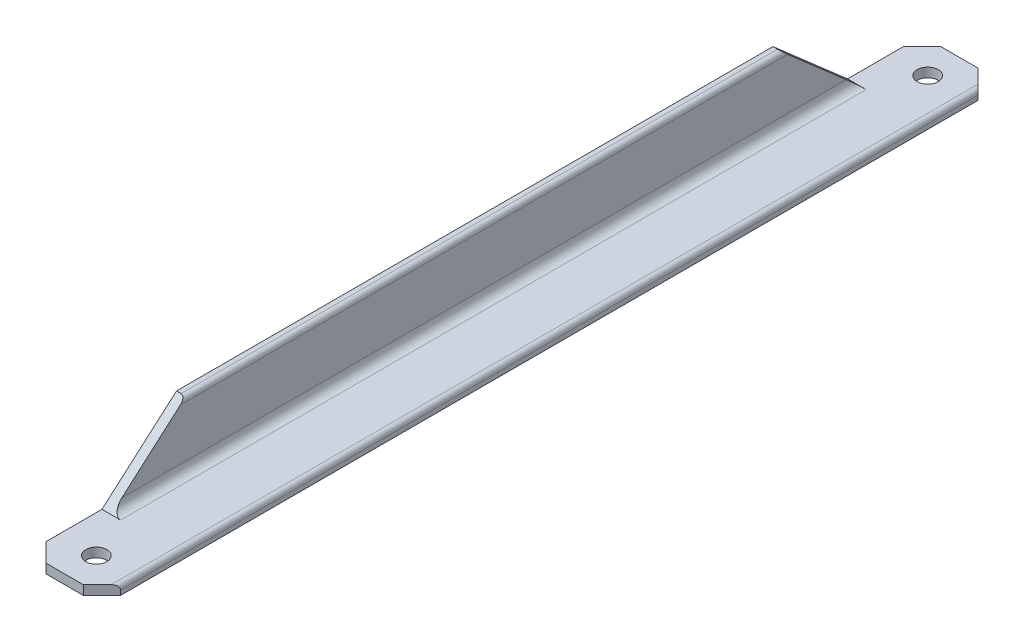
ISO-10303-21;
HEADER;
FILE_DESCRIPTION(('STEP AP214'),'2;1');
FILE_NAME('part.step','',(''),(''),'','','');
FILE_SCHEMA(('AUTOMOTIVE_DESIGN { 1 0 10303 214 1 1 1 1 }'));
ENDSEC;
DATA;
#1=APPLICATION_CONTEXT('core data for automotive mechanical design processes');
#2=APPLICATION_PROTOCOL_DEFINITION('international standard','automotive_design',2000,#1);
#3=PRODUCT_CONTEXT('',#1,'mechanical');
#4=PRODUCT('Part','Part','',(#3));
#5=PRODUCT_RELATED_PRODUCT_CATEGORY('part','',(#4));
#6=PRODUCT_DEFINITION_FORMATION('','',#4);
#7=PRODUCT_DEFINITION_CONTEXT('part definition',#1,'design');
#8=PRODUCT_DEFINITION('design','',#6,#7);
#9=PRODUCT_DEFINITION_SHAPE('','',#8);
#10=(LENGTH_UNIT() NAMED_UNIT(*) SI_UNIT(.MILLI.,.METRE.));
#11=(NAMED_UNIT(*) PLANE_ANGLE_UNIT() SI_UNIT($,.RADIAN.));
#12=(NAMED_UNIT(*) SI_UNIT($,.STERADIAN.) SOLID_ANGLE_UNIT());
#13=UNCERTAINTY_MEASURE_WITH_UNIT(LENGTH_MEASURE(1.E-05),#10,'distance_accuracy_value','');
#14=(GEOMETRIC_REPRESENTATION_CONTEXT(3) GLOBAL_UNCERTAINTY_ASSIGNED_CONTEXT((#13)) GLOBAL_UNIT_ASSIGNED_CONTEXT((#10,
#11,#12)) REPRESENTATION_CONTEXT('',''));
#15=CARTESIAN_POINT('',(0.,0.,0.));
#16=DIRECTION('',(0.,0.,1.));
#17=DIRECTION('',(1.,0.,0.));
#18=AXIS2_PLACEMENT_3D('',#15,#16,#17);
#19=CARTESIAN_POINT('',(0.,0.,304.800000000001));
#20=DIRECTION('',(0.,1.,0.));
#21=DIRECTION('',(0.,0.,1.));
#22=AXIS2_PLACEMENT_3D('',#19,#20,#21);
#23=PLANE('',#22);
#24=CARTESIAN_POINT('',(25.4,-1.66533453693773E-13,283.210000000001));
#25=DIRECTION('',(0.,1.,0.));
#26=DIRECTION('',(0.,0.,-1.));
#27=AXIS2_PLACEMENT_3D('',#24,#25,#26);
#28=CIRCLE('',#27,7.1374);
#29=CARTESIAN_POINT('',(25.4,-1.66533453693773E-13,276.072600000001));
#30=VERTEX_POINT('',#29);
#31=EDGE_CURVE('E276',#30,#30,#28,.T.);
#32=ORIENTED_EDGE('',*,*,#31,.T.);
#33=EDGE_LOOP('',(#32));
#34=FACE_BOUND('',#33,.T.);
#35=CARTESIAN_POINT('',(25.4,-1.66533453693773E-13,-283.21));
#36=DIRECTION('',(0.,1.,0.));
#37=DIRECTION('',(0.,0.,1.));
#38=AXIS2_PLACEMENT_3D('',#35,#36,#37);
#39=CIRCLE('',#38,7.1374);
#40=CARTESIAN_POINT('',(25.4,-1.66533453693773E-13,-276.0726));
#41=VERTEX_POINT('',#40);
#42=EDGE_CURVE('E268',#41,#41,#39,.T.);
#43=ORIENTED_EDGE('',*,*,#42,.T.);
#44=EDGE_LOOP('',(#43));
#45=FACE_BOUND('',#44,.T.);
#46=DIRECTION('',(1.,0.,0.));
#47=VECTOR('',#46,1.);
#48=CARTESIAN_POINT('',(0.,0.,-304.8));
#49=LINE('',#48,#47);
#50=CARTESIAN_POINT('',(12.7,-1.66533453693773E-13,-304.8));
#51=VERTEX_POINT('',#50);
#52=CARTESIAN_POINT('',(38.1,0.,-304.8));
#53=VERTEX_POINT('',#52);
#54=EDGE_CURVE('E160',#51,#53,#49,.T.);
#55=ORIENTED_EDGE('',*,*,#54,.T.);
#56=DIRECTION('',(0.707106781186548,0.,0.707106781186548));
#57=VECTOR('',#56,1.);
#58=CARTESIAN_POINT('',(38.1,0.,-304.8));
#59=LINE('',#58,#57);
#60=CARTESIAN_POINT('',(50.8,0.,-292.1));
#61=VERTEX_POINT('',#60);
#62=EDGE_CURVE('E144',#53,#61,#59,.T.);
#63=ORIENTED_EDGE('',*,*,#62,.T.);
#64=DIRECTION('',(0.,0.,-1.));
#65=VECTOR('',#64,1.);
#66=CARTESIAN_POINT('',(50.8,0.,304.800000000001));
#67=LINE('',#66,#65);
#68=CARTESIAN_POINT('',(50.8,0.,292.100000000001));
#69=VERTEX_POINT('',#68);
#70=EDGE_CURVE('E11',#69,#61,#67,.T.);
#71=ORIENTED_EDGE('',*,*,#70,.F.);
#72=DIRECTION('',(-0.707106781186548,0.,0.707106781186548));
#73=VECTOR('',#72,1.);
#74=CARTESIAN_POINT('',(38.1,0.,304.800000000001));
#75=LINE('',#74,#73);
#76=CARTESIAN_POINT('',(38.1,0.,304.800000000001));
#77=VERTEX_POINT('',#76);
#78=EDGE_CURVE('E168',#69,#77,#75,.T.);
#79=ORIENTED_EDGE('',*,*,#78,.T.);
#80=DIRECTION('',(1.,0.,0.));
#81=VECTOR('',#80,1.);
#82=CARTESIAN_POINT('',(0.,0.,304.800000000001));
#83=LINE('',#82,#81);
#84=CARTESIAN_POINT('',(12.6999999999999,-1.66533453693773E-13,304.800000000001));
#85=VERTEX_POINT('',#84);
#86=EDGE_CURVE('E238',#85,#77,#83,.T.);
#87=ORIENTED_EDGE('',*,*,#86,.F.);
#88=DIRECTION('',(-0.707106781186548,0.,-0.707106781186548));
#89=VECTOR('',#88,1.);
#90=CARTESIAN_POINT('',(12.6999999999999,-1.66533453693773E-13,304.800000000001));
#91=LINE('',#90,#89);
#92=CARTESIAN_POINT('',(0.,0.,292.100000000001));
#93=VERTEX_POINT('',#92);
#94=EDGE_CURVE('E50',#85,#93,#91,.T.);
#95=ORIENTED_EDGE('',*,*,#94,.T.);
#96=DIRECTION('',(0.,0.,-1.));
#97=VECTOR('',#96,1.);
#98=CARTESIAN_POINT('',(0.,0.,304.800000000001));
#99=LINE('',#98,#97);
#100=CARTESIAN_POINT('',(0.,0.,-292.1));
#101=VERTEX_POINT('',#100);
#102=EDGE_CURVE('E245',#93,#101,#99,.T.);
#103=ORIENTED_EDGE('',*,*,#102,.T.);
#104=DIRECTION('',(0.707106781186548,0.,-0.707106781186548));
#105=VECTOR('',#104,1.);
#106=CARTESIAN_POINT('',(12.7,-1.66533453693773E-13,-304.8));
#107=LINE('',#106,#105);
#108=EDGE_CURVE('E189',#101,#51,#107,.T.);
#109=ORIENTED_EDGE('',*,*,#108,.T.);
#110=EDGE_LOOP('',(#55,#63,#71,#79,#87,#95,#103,#109));
#111=FACE_BOUND('',#110,.T.);
#112=ADVANCED_FACE('F34',(#34,#45,#111),#23,.F.);
#113=CARTESIAN_POINT('',(50.8,3.17499999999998,304.800000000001));
#114=DIRECTION('',(-1.,0.,0.));
#115=DIRECTION('',(0.,0.,1.));
#116=AXIS2_PLACEMENT_3D('',#113,#114,#115);
#117=PLANE('',#116);
#118=ORIENTED_EDGE('',*,*,#70,.T.);
#119=DIRECTION('',(0.,1.,0.));
#120=VECTOR('',#119,1.);
#121=CARTESIAN_POINT('',(50.8,0.,-292.1));
#122=LINE('',#121,#120);
#123=CARTESIAN_POINT('',(50.8,3.17499999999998,-292.1));
#124=VERTEX_POINT('',#123);
#125=EDGE_CURVE('E141',#61,#124,#122,.T.);
#126=ORIENTED_EDGE('',*,*,#125,.T.);
#127=DIRECTION('',(0.,0.,-1.));
#128=VECTOR('',#127,1.);
#129=CARTESIAN_POINT('',(50.8,3.17499999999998,304.800000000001));
#130=LINE('',#129,#128);
#131=CARTESIAN_POINT('',(50.8,3.17499999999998,292.100000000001));
#132=VERTEX_POINT('',#131);
#133=EDGE_CURVE('E42',#132,#124,#130,.T.);
#134=ORIENTED_EDGE('',*,*,#133,.F.);
#135=DIRECTION('',(0.,1.,0.));
#136=VECTOR('',#135,1.);
#137=CARTESIAN_POINT('',(50.8,0.,292.100000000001));
#138=LINE('',#137,#136);
#139=EDGE_CURVE('E161',#69,#132,#138,.T.);
#140=ORIENTED_EDGE('',*,*,#139,.F.);
#141=EDGE_LOOP('',(#118,#126,#134,#140));
#142=FACE_BOUND('',#141,.T.);
#143=ADVANCED_FACE('F164',(#142),#117,.F.);
#144=CARTESIAN_POINT('',(47.625,3.17499999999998,304.800000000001));
#145=DIRECTION('',(0.,0.,-1.));
#146=DIRECTION('',(-1.,0.,0.));
#147=AXIS2_PLACEMENT_3D('',#144,#145,#146);
#148=CYLINDRICAL_SURFACE('',#147,3.175);
#149=ORIENTED_EDGE('',*,*,#133,.T.);
#150=CARTESIAN_POINT('',(47.625,3.17499999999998,-295.275));
#151=DIRECTION('',(-0.707106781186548,0.,0.707106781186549));
#152=DIRECTION('',(-0.707106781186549,0.,-0.707106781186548));
#153=AXIS2_PLACEMENT_3D('',#150,#151,#152);
#154=ELLIPSE('',#153,4.49012806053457,3.175);
#155=CARTESIAN_POINT('',(47.625,6.35000000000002,-295.275));
#156=VERTEX_POINT('',#155);
#157=EDGE_CURVE('E147',#124,#156,#154,.T.);
#158=ORIENTED_EDGE('',*,*,#157,.T.);
#159=DIRECTION('',(0.,0.,-1.));
#160=VECTOR('',#159,1.);
#161=CARTESIAN_POINT('',(47.625,6.35000000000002,304.800000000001));
#162=LINE('',#161,#160);
#163=CARTESIAN_POINT('',(47.625,6.35000000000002,295.275000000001));
#164=VERTEX_POINT('',#163);
#165=EDGE_CURVE('E264',#164,#156,#162,.T.);
#166=ORIENTED_EDGE('',*,*,#165,.F.);
#167=CARTESIAN_POINT('',(47.625,3.17499999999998,295.275000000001));
#168=DIRECTION('',(-0.707106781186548,0.,-0.707106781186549));
#169=DIRECTION('',(0.707106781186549,0.,-0.707106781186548));
#170=AXIS2_PLACEMENT_3D('',#167,#168,#169);
#171=ELLIPSE('',#170,4.49012806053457,3.175);
#172=EDGE_CURVE('E187',#164,#132,#171,.T.);
#173=ORIENTED_EDGE('',*,*,#172,.T.);
#174=EDGE_LOOP('',(#149,#158,#166,#173));
#175=FACE_BOUND('',#174,.T.);
#176=ADVANCED_FACE('F330',(#175),#148,.T.);
#177=CARTESIAN_POINT('',(12.7,6.34999999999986,304.800000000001));
#178=DIRECTION('',(0.,-1.,0.));
#179=DIRECTION('',(0.,0.,-1.));
#180=AXIS2_PLACEMENT_3D('',#177,#178,#179);
#181=PLANE('',#180);
#182=CARTESIAN_POINT('',(25.4,6.34999999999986,283.210000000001));
#183=DIRECTION('',(0.,-1.,0.));
#184=DIRECTION('',(0.,0.,-1.));
#185=AXIS2_PLACEMENT_3D('',#182,#183,#184);
#186=CIRCLE('',#185,7.1374);
#187=CARTESIAN_POINT('',(25.4,6.34999999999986,276.072600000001));
#188=VERTEX_POINT('',#187);
#189=EDGE_CURVE('E37',#188,#188,#186,.T.);
#190=ORIENTED_EDGE('',*,*,#189,.T.);
#191=EDGE_LOOP('',(#190));
#192=FACE_BOUND('',#191,.T.);
#193=CARTESIAN_POINT('',(25.3999999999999,6.34999999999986,-283.21));
#194=DIRECTION('',(0.,-1.,0.));
#195=DIRECTION('',(0.,0.,-1.));
#196=AXIS2_PLACEMENT_3D('',#193,#194,#195);
#197=CIRCLE('',#196,7.1374);
#198=CARTESIAN_POINT('',(25.3999999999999,6.34999999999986,-290.3474));
#199=VERTEX_POINT('',#198);
#200=EDGE_CURVE('E175',#199,#199,#197,.T.);
#201=ORIENTED_EDGE('',*,*,#200,.T.);
#202=EDGE_LOOP('',(#201));
#203=FACE_BOUND('',#202,.T.);
#204=ORIENTED_EDGE('',*,*,#165,.T.);
#205=DIRECTION('',(-0.707106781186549,0.,-0.707106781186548));
#206=VECTOR('',#205,1.);
#207=CARTESIAN_POINT('',(330.2,6.35000000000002,-12.7000000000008));
#208=LINE('',#207,#206);
#209=CARTESIAN_POINT('',(38.1,6.34999999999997,-304.8));
#210=VERTEX_POINT('',#209);
#211=EDGE_CURVE('E151',#156,#210,#208,.T.);
#212=ORIENTED_EDGE('',*,*,#211,.T.);
#213=DIRECTION('',(-1.,0.,0.));
#214=VECTOR('',#213,1.);
#215=CARTESIAN_POINT('',(12.7,6.34999999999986,-304.8));
#216=LINE('',#215,#214);
#217=CARTESIAN_POINT('',(12.7,6.34999999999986,-304.8));
#218=VERTEX_POINT('',#217);
#219=EDGE_CURVE('E242',#210,#218,#216,.T.);
#220=ORIENTED_EDGE('',*,*,#219,.T.);
#221=DIRECTION('',(-0.707106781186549,0.,0.707106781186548));
#222=VECTOR('',#221,1.);
#223=CARTESIAN_POINT('',(-292.1,6.34999999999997,-4.44089209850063E-13));
#224=LINE('',#223,#222);
#225=CARTESIAN_POINT('',(0.,6.35000000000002,-292.1));
#226=VERTEX_POINT('',#225);
#227=EDGE_CURVE('E195',#218,#226,#224,.T.);
#228=ORIENTED_EDGE('',*,*,#227,.T.);
#229=DIRECTION('',(0.,0.,-1.));
#230=VECTOR('',#229,1.);
#231=CARTESIAN_POINT('',(0.,6.35000000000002,-304.8));
#232=LINE('',#231,#230);
#233=CARTESIAN_POINT('',(0.,6.34999999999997,-254.));
#234=VERTEX_POINT('',#233);
#235=EDGE_CURVE('E202',#234,#226,#232,.T.);
#236=ORIENTED_EDGE('',*,*,#235,.F.);
#237=DIRECTION('',(1.,0.,0.));
#238=VECTOR('',#237,1.);
#239=CARTESIAN_POINT('',(0.,6.34999999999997,-254.));
#240=LINE('',#239,#238);
#241=CARTESIAN_POINT('',(12.7,6.34999999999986,-254.));
#242=VERTEX_POINT('',#241);
#243=EDGE_CURVE('E206',#234,#242,#240,.T.);
#244=ORIENTED_EDGE('',*,*,#243,.T.);
#245=DIRECTION('',(0.,0.,-1.));
#246=VECTOR('',#245,1.);
#247=CARTESIAN_POINT('',(12.7,6.34999999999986,304.800000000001));
#248=LINE('',#247,#246);
#249=CARTESIAN_POINT('',(12.7,6.34999999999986,254.));
#250=VERTEX_POINT('',#249);
#251=EDGE_CURVE('E261',#250,#242,#248,.T.);
#252=ORIENTED_EDGE('',*,*,#251,.F.);
#253=DIRECTION('',(1.,0.,0.));
#254=VECTOR('',#253,1.);
#255=CARTESIAN_POINT('',(0.,6.35000000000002,254.));
#256=LINE('',#255,#254);
#257=CARTESIAN_POINT('',(0.,6.35000000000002,254.));
#258=VERTEX_POINT('',#257);
#259=EDGE_CURVE('E224',#258,#250,#256,.T.);
#260=ORIENTED_EDGE('',*,*,#259,.F.);
#261=DIRECTION('',(0.,0.,-1.));
#262=VECTOR('',#261,1.);
#263=CARTESIAN_POINT('',(0.,6.35000000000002,304.800000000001));
#264=LINE('',#263,#262);
#265=CARTESIAN_POINT('',(0.,6.35000000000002,292.100000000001));
#266=VERTEX_POINT('',#265);
#267=EDGE_CURVE('E219',#266,#258,#264,.T.);
#268=ORIENTED_EDGE('',*,*,#267,.F.);
#269=DIRECTION('',(0.707106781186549,0.,0.707106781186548));
#270=VECTOR('',#269,1.);
#271=CARTESIAN_POINT('',(12.6999999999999,6.34999999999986,304.800000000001));
#272=LINE('',#271,#270);
#273=CARTESIAN_POINT('',(12.6999999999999,6.34999999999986,304.800000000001));
#274=VERTEX_POINT('',#273);
#275=EDGE_CURVE('E183',#266,#274,#272,.T.);
#276=ORIENTED_EDGE('',*,*,#275,.T.);
#277=DIRECTION('',(-1.,0.,0.));
#278=VECTOR('',#277,1.);
#279=CARTESIAN_POINT('',(12.7,6.34999999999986,304.800000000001));
#280=LINE('',#279,#278);
#281=CARTESIAN_POINT('',(38.0999999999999,6.34999999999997,304.800000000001));
#282=VERTEX_POINT('',#281);
#283=EDGE_CURVE('E241',#282,#274,#280,.T.);
#284=ORIENTED_EDGE('',*,*,#283,.F.);
#285=DIRECTION('',(0.707106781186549,0.,-0.707106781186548));
#286=VECTOR('',#285,1.);
#287=CARTESIAN_POINT('',(25.3999999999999,6.34999999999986,317.500000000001));
#288=LINE('',#287,#286);
#289=EDGE_CURVE('E58',#282,#164,#288,.T.);
#290=ORIENTED_EDGE('',*,*,#289,.T.);
#291=EDGE_LOOP('',(#204,#212,#220,#228,#236,#244,#252,#260,#268,#276,#284,#290));
#292=FACE_BOUND('',#291,.T.);
#293=ADVANCED_FACE('F281',(#192,#203,#292),#181,.F.);
#294=CARTESIAN_POINT('',(12.7,12.6999999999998,304.800000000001));
#295=DIRECTION('',(0.,0.,-1.));
#296=DIRECTION('',(-1.,0.,0.));
#297=AXIS2_PLACEMENT_3D('',#294,#295,#296);
#298=CYLINDRICAL_SURFACE('',#297,6.35);
#299=ORIENTED_EDGE('',*,*,#251,.T.);
#300=CARTESIAN_POINT('',(12.7000000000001,12.6999999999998,-246.742857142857));
#301=DIRECTION('',(0.,-0.752576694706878,0.658504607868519));
#302=DIRECTION('',(0.,-0.658504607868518,-0.752576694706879));
#303=AXIS2_PLACEMENT_3D('',#300,#301,#302);
#304=ELLIPSE('',#303,9.64306084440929,6.35);
#305=CARTESIAN_POINT('',(6.35000000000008,12.6999999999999,-246.742857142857));
#306=VERTEX_POINT('',#305);
#307=EDGE_CURVE('E216',#242,#306,#304,.F.);
#308=ORIENTED_EDGE('',*,*,#307,.T.);
#309=DIRECTION('',(0.,0.,-1.));
#310=VECTOR('',#309,1.);
#311=CARTESIAN_POINT('',(6.34999999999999,12.7,304.800000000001));
#312=LINE('',#311,#310);
#313=CARTESIAN_POINT('',(6.35000000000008,12.7,246.742857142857));
#314=VERTEX_POINT('',#313);
#315=EDGE_CURVE('E258',#314,#306,#312,.T.);
#316=ORIENTED_EDGE('',*,*,#315,.F.);
#317=CARTESIAN_POINT('',(12.7000000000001,12.6999999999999,246.742857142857));
#318=DIRECTION('',(0.,-0.752576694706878,-0.658504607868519));
#319=DIRECTION('',(0.,0.658504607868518,-0.752576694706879));
#320=AXIS2_PLACEMENT_3D('',#317,#318,#319);
#321=ELLIPSE('',#320,9.64306084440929,6.35);
#322=EDGE_CURVE('E235',#314,#250,#321,.F.);
#323=ORIENTED_EDGE('',*,*,#322,.T.);
#324=EDGE_LOOP('',(#299,#308,#316,#323));
#325=FACE_BOUND('',#324,.T.);
#326=ADVANCED_FACE('F310',(#325),#298,.F.);
#327=CARTESIAN_POINT('',(6.34999999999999,12.7,304.800000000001));
#328=DIRECTION('',(-1.,0.,0.));
#329=DIRECTION('',(0.,0.,1.));
#330=AXIS2_PLACEMENT_3D('',#327,#328,#329);
#331=PLANE('',#330);
#332=ORIENTED_EDGE('',*,*,#315,.T.);
#333=DIRECTION('',(0.,0.658504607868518,0.752576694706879));
#334=VECTOR('',#333,1.);
#335=CARTESIAN_POINT('',(6.34999999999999,286.030973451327,65.6353982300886));
#336=LINE('',#335,#334);
#337=CARTESIAN_POINT('',(6.34999999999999,47.6249999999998,-206.828571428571));
#338=VERTEX_POINT('',#337);
#339=EDGE_CURVE('E213',#306,#338,#336,.T.);
#340=ORIENTED_EDGE('',*,*,#339,.T.);
#341=DIRECTION('',(0.,0.,-1.));
#342=VECTOR('',#341,1.);
#343=CARTESIAN_POINT('',(6.34999999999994,47.625,304.800000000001));
#344=LINE('',#343,#342);
#345=CARTESIAN_POINT('',(6.34999999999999,47.625,206.828571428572));
#346=VERTEX_POINT('',#345);
#347=EDGE_CURVE('E255',#346,#338,#344,.T.);
#348=ORIENTED_EDGE('',*,*,#347,.F.);
#349=DIRECTION('',(0.,-0.658504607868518,0.752576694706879));
#350=VECTOR('',#349,1.);
#351=CARTESIAN_POINT('',(6.34999999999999,-16.0716814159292,279.624778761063));
#352=LINE('',#351,#350);
#353=EDGE_CURVE('E232',#346,#314,#352,.T.);
#354=ORIENTED_EDGE('',*,*,#353,.T.);
#355=EDGE_LOOP('',(#332,#340,#348,#354));
#356=FACE_BOUND('',#355,.T.);
#357=ADVANCED_FACE('F307',(#356),#331,.F.);
#358=CARTESIAN_POINT('',(3.17499999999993,47.625,304.800000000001));
#359=DIRECTION('',(0.,0.,-1.));
#360=DIRECTION('',(-1.,0.,0.));
#361=AXIS2_PLACEMENT_3D('',#358,#359,#360);
#362=CYLINDRICAL_SURFACE('',#361,3.175);
#363=ORIENTED_EDGE('',*,*,#347,.T.);
#364=CARTESIAN_POINT('',(3.17499999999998,47.6249999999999,-206.828571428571));
#365=DIRECTION('',(0.,-0.752576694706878,0.658504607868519));
#366=DIRECTION('',(0.,-0.658504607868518,-0.752576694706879));
#367=AXIS2_PLACEMENT_3D('',#364,#365,#366);
#368=ELLIPSE('',#367,4.82153042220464,3.175);
#369=CARTESIAN_POINT('',(3.17499999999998,50.7999999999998,-203.2));
#370=VERTEX_POINT('',#369);
#371=EDGE_CURVE('E209',#338,#370,#368,.T.);
#372=ORIENTED_EDGE('',*,*,#371,.T.);
#373=DIRECTION('',(0.,0.,-1.));
#374=VECTOR('',#373,1.);
#375=CARTESIAN_POINT('',(3.17499999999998,50.8,304.800000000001));
#376=LINE('',#375,#374);
#377=CARTESIAN_POINT('',(3.17499999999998,50.8,203.2));
#378=VERTEX_POINT('',#377);
#379=EDGE_CURVE('E252',#378,#370,#376,.T.);
#380=ORIENTED_EDGE('',*,*,#379,.F.);
#381=CARTESIAN_POINT('',(3.17499999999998,47.625,206.828571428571));
#382=DIRECTION('',(0.,-0.752576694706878,-0.658504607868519));
#383=DIRECTION('',(0.,0.658504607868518,-0.752576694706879));
#384=AXIS2_PLACEMENT_3D('',#381,#382,#383);
#385=ELLIPSE('',#384,4.82153042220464,3.175);
#386=EDGE_CURVE('E228',#378,#346,#385,.T.);
#387=ORIENTED_EDGE('',*,*,#386,.T.);
#388=EDGE_LOOP('',(#363,#372,#380,#387));
#389=FACE_BOUND('',#388,.T.);
#390=ADVANCED_FACE('F304',(#389),#362,.T.);
#391=CARTESIAN_POINT('',(3.17499999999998,50.8,304.800000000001));
#392=DIRECTION('',(0.,-1.,0.));
#393=DIRECTION('',(0.,0.,-1.));
#394=AXIS2_PLACEMENT_3D('',#391,#392,#393);
#395=PLANE('',#394);
#396=ORIENTED_EDGE('',*,*,#379,.T.);
#397=DIRECTION('',(1.,0.,0.));
#398=VECTOR('',#397,1.);
#399=CARTESIAN_POINT('',(0.,50.8,-203.2));
#400=LINE('',#399,#398);
#401=CARTESIAN_POINT('',(0.,50.8,-203.2));
#402=VERTEX_POINT('',#401);
#403=EDGE_CURVE('E205',#402,#370,#400,.T.);
#404=ORIENTED_EDGE('',*,*,#403,.F.);
#405=DIRECTION('',(0.,0.,-1.));
#406=VECTOR('',#405,1.);
#407=CARTESIAN_POINT('',(0.,50.8,304.800000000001));
#408=LINE('',#407,#406);
#409=CARTESIAN_POINT('',(0.,50.8,203.2));
#410=VERTEX_POINT('',#409);
#411=EDGE_CURVE('E249',#410,#402,#408,.T.);
#412=ORIENTED_EDGE('',*,*,#411,.F.);
#413=DIRECTION('',(1.,0.,0.));
#414=VECTOR('',#413,1.);
#415=CARTESIAN_POINT('',(0.,50.8,203.2));
#416=LINE('',#415,#414);
#417=EDGE_CURVE('E225',#410,#378,#416,.T.);
#418=ORIENTED_EDGE('',*,*,#417,.T.);
#419=EDGE_LOOP('',(#396,#404,#412,#418));
#420=FACE_BOUND('',#419,.T.);
#421=ADVANCED_FACE('F301',(#420),#395,.F.);
#422=CARTESIAN_POINT('',(0.,0.,304.800000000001));
#423=DIRECTION('',(1.,0.,0.));
#424=DIRECTION('',(0.,0.,-1.));
#425=AXIS2_PLACEMENT_3D('',#422,#423,#424);
#426=PLANE('',#425);
#427=ORIENTED_EDGE('',*,*,#102,.F.);
#428=DIRECTION('',(0.,1.,0.));
#429=VECTOR('',#428,1.);
#430=CARTESIAN_POINT('',(0.,0.,292.100000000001));
#431=LINE('',#430,#429);
#432=EDGE_CURVE('E174',#93,#266,#431,.T.);
#433=ORIENTED_EDGE('',*,*,#432,.T.);
#434=ORIENTED_EDGE('',*,*,#267,.T.);
#435=DIRECTION('',(0.,0.658504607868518,-0.752576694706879));
#436=VECTOR('',#435,1.);
#437=CARTESIAN_POINT('',(0.,6.35000000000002,254.));
#438=LINE('',#437,#436);
#439=EDGE_CURVE('E221',#258,#410,#438,.T.);
#440=ORIENTED_EDGE('',*,*,#439,.T.);
#441=ORIENTED_EDGE('',*,*,#411,.T.);
#442=DIRECTION('',(0.,-0.658504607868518,-0.752576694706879));
#443=VECTOR('',#442,1.);
#444=CARTESIAN_POINT('',(0.,6.34999999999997,-254.));
#445=LINE('',#444,#443);
#446=EDGE_CURVE('E199',#402,#234,#445,.T.);
#447=ORIENTED_EDGE('',*,*,#446,.T.);
#448=ORIENTED_EDGE('',*,*,#235,.T.);
#449=DIRECTION('',(0.,1.,0.));
#450=VECTOR('',#449,1.);
#451=CARTESIAN_POINT('',(0.,0.,-292.1));
#452=LINE('',#451,#450);
#453=EDGE_CURVE('E191',#101,#226,#452,.T.);
#454=ORIENTED_EDGE('',*,*,#453,.F.);
#455=EDGE_LOOP('',(#427,#433,#434,#440,#441,#447,#448,#454));
#456=FACE_BOUND('',#455,.T.);
#457=ADVANCED_FACE('F292',(#456),#426,.F.);
#458=CARTESIAN_POINT('',(47.625,3.17499999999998,304.800000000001));
#459=DIRECTION('',(0.,0.,1.));
#460=DIRECTION('',(1.,0.,0.));
#461=AXIS2_PLACEMENT_3D('',#458,#459,#460);
#462=PLANE('',#461);
#463=DIRECTION('',(0.,1.,0.));
#464=VECTOR('',#463,1.);
#465=CARTESIAN_POINT('',(38.1,0.,304.800000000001));
#466=LINE('',#465,#464);
#467=EDGE_CURVE('E166',#77,#282,#466,.T.);
#468=ORIENTED_EDGE('',*,*,#467,.T.);
#469=ORIENTED_EDGE('',*,*,#283,.T.);
#470=DIRECTION('',(0.,1.,0.));
#471=VECTOR('',#470,1.);
#472=CARTESIAN_POINT('',(12.6999999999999,-1.66533453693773E-13,304.800000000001));
#473=LINE('',#472,#471);
#474=EDGE_CURVE('E176',#85,#274,#473,.T.);
#475=ORIENTED_EDGE('',*,*,#474,.F.);
#476=ORIENTED_EDGE('',*,*,#86,.T.);
#477=EDGE_LOOP('',(#468,#469,#475,#476));
#478=FACE_BOUND('',#477,.T.);
#479=ADVANCED_FACE('F322',(#478),#462,.T.);
#480=CARTESIAN_POINT('',(47.625,3.17499999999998,-304.8));
#481=DIRECTION('',(0.,0.,1.));
#482=DIRECTION('',(1.,0.,0.));
#483=AXIS2_PLACEMENT_3D('',#480,#481,#482);
#484=PLANE('',#483);
#485=ORIENTED_EDGE('',*,*,#219,.F.);
#486=DIRECTION('',(0.,1.,0.));
#487=VECTOR('',#486,1.);
#488=CARTESIAN_POINT('',(38.1,0.,-304.8));
#489=LINE('',#488,#487);
#490=EDGE_CURVE('E152',#53,#210,#489,.T.);
#491=ORIENTED_EDGE('',*,*,#490,.F.);
#492=ORIENTED_EDGE('',*,*,#54,.F.);
#493=DIRECTION('',(0.,1.,0.));
#494=VECTOR('',#493,1.);
#495=CARTESIAN_POINT('',(12.7,-1.66533453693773E-13,-304.8));
#496=LINE('',#495,#494);
#497=EDGE_CURVE('E192',#51,#218,#496,.T.);
#498=ORIENTED_EDGE('',*,*,#497,.T.);
#499=EDGE_LOOP('',(#485,#491,#492,#498));
#500=FACE_BOUND('',#499,.T.);
#501=ADVANCED_FACE('F284',(#500),#484,.F.);
#502=CARTESIAN_POINT('',(0.,6.35000000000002,254.));
#503=DIRECTION('',(0.,-0.752576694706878,-0.658504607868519));
#504=DIRECTION('',(0.,0.658504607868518,-0.752576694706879));
#505=AXIS2_PLACEMENT_3D('',#502,#503,#504);
#506=PLANE('',#505);
#507=ORIENTED_EDGE('',*,*,#353,.F.);
#508=ORIENTED_EDGE('',*,*,#386,.F.);
#509=ORIENTED_EDGE('',*,*,#417,.F.);
#510=ORIENTED_EDGE('',*,*,#439,.F.);
#511=ORIENTED_EDGE('',*,*,#259,.T.);
#512=ORIENTED_EDGE('',*,*,#322,.F.);
#513=EDGE_LOOP('',(#507,#508,#509,#510,#511,#512));
#514=FACE_BOUND('',#513,.T.);
#515=ADVANCED_FACE('F314',(#514),#506,.F.);
#516=CARTESIAN_POINT('',(0.,6.34999999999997,-254.));
#517=DIRECTION('',(0.,-0.752576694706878,0.658504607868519));
#518=DIRECTION('',(0.,-0.658504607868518,-0.752576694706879));
#519=AXIS2_PLACEMENT_3D('',#516,#517,#518);
#520=PLANE('',#519);
#521=ORIENTED_EDGE('',*,*,#243,.F.);
#522=ORIENTED_EDGE('',*,*,#446,.F.);
#523=ORIENTED_EDGE('',*,*,#403,.T.);
#524=ORIENTED_EDGE('',*,*,#371,.F.);
#525=ORIENTED_EDGE('',*,*,#339,.F.);
#526=ORIENTED_EDGE('',*,*,#307,.F.);
#527=EDGE_LOOP('',(#521,#522,#523,#524,#525,#526));
#528=FACE_BOUND('',#527,.T.);
#529=ADVANCED_FACE('F299',(#528),#520,.F.);
#530=CARTESIAN_POINT('',(12.7,-1.66533453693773E-13,-304.8));
#531=DIRECTION('',(0.707106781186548,0.,0.707106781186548));
#532=DIRECTION('',(0.707106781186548,0.,-0.707106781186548));
#533=AXIS2_PLACEMENT_3D('',#530,#531,#532);
#534=PLANE('',#533);
#535=ORIENTED_EDGE('',*,*,#497,.F.);
#536=ORIENTED_EDGE('',*,*,#108,.F.);
#537=ORIENTED_EDGE('',*,*,#453,.T.);
#538=ORIENTED_EDGE('',*,*,#227,.F.);
#539=EDGE_LOOP('',(#535,#536,#537,#538));
#540=FACE_BOUND('',#539,.T.);
#541=ADVANCED_FACE('F287',(#540),#534,.F.);
#542=CARTESIAN_POINT('',(38.1,0.,-304.8));
#543=DIRECTION('',(-0.707106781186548,0.,0.707106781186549));
#544=DIRECTION('',(0.707106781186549,0.,0.707106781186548));
#545=AXIS2_PLACEMENT_3D('',#542,#543,#544);
#546=PLANE('',#545);
#547=ORIENTED_EDGE('',*,*,#125,.F.);
#548=ORIENTED_EDGE('',*,*,#62,.F.);
#549=ORIENTED_EDGE('',*,*,#490,.T.);
#550=ORIENTED_EDGE('',*,*,#211,.F.);
#551=ORIENTED_EDGE('',*,*,#157,.F.);
#552=EDGE_LOOP('',(#547,#548,#549,#550,#551));
#553=FACE_BOUND('',#552,.T.);
#554=ADVANCED_FACE('F143',(#553),#546,.F.);
#555=CARTESIAN_POINT('',(12.6999999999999,-1.66533453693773E-13,304.800000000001));
#556=DIRECTION('',(0.707106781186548,0.,-0.707106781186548));
#557=DIRECTION('',(-0.707106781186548,0.,-0.707106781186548));
#558=AXIS2_PLACEMENT_3D('',#555,#556,#557);
#559=PLANE('',#558);
#560=ORIENTED_EDGE('',*,*,#432,.F.);
#561=ORIENTED_EDGE('',*,*,#94,.F.);
#562=ORIENTED_EDGE('',*,*,#474,.T.);
#563=ORIENTED_EDGE('',*,*,#275,.F.);
#564=EDGE_LOOP('',(#560,#561,#562,#563));
#565=FACE_BOUND('',#564,.T.);
#566=ADVANCED_FACE('F363',(#565),#559,.F.);
#567=CARTESIAN_POINT('',(38.1,0.,304.800000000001));
#568=DIRECTION('',(-0.707106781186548,0.,-0.707106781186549));
#569=DIRECTION('',(-0.707106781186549,0.,0.707106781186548));
#570=AXIS2_PLACEMENT_3D('',#567,#568,#569);
#571=PLANE('',#570);
#572=ORIENTED_EDGE('',*,*,#289,.F.);
#573=ORIENTED_EDGE('',*,*,#467,.F.);
#574=ORIENTED_EDGE('',*,*,#78,.F.);
#575=ORIENTED_EDGE('',*,*,#139,.T.);
#576=ORIENTED_EDGE('',*,*,#172,.F.);
#577=EDGE_LOOP('',(#572,#573,#574,#575,#576));
#578=FACE_BOUND('',#577,.T.);
#579=ADVANCED_FACE('F364',(#578),#571,.F.);
#580=CARTESIAN_POINT('',(25.4,-1.66533453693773E-13,-283.21));
#581=DIRECTION('',(0.,1.,0.));
#582=DIRECTION('',(0.,0.,1.));
#583=AXIS2_PLACEMENT_3D('',#580,#581,#582);
#584=CYLINDRICAL_SURFACE('',#583,7.1374);
#585=ORIENTED_EDGE('',*,*,#42,.F.);
#586=EDGE_LOOP('',(#585));
#587=FACE_BOUND('',#586,.T.);
#588=ORIENTED_EDGE('',*,*,#200,.F.);
#589=EDGE_LOOP('',(#588));
#590=FACE_BOUND('',#589,.T.);
#591=ADVANCED_FACE('F337',(#587,#590),#584,.F.);
#592=CARTESIAN_POINT('',(25.4,-1.66533453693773E-13,283.210000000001));
#593=DIRECTION('',(0.,1.,0.));
#594=DIRECTION('',(0.,0.,1.));
#595=AXIS2_PLACEMENT_3D('',#592,#593,#594);
#596=CYLINDRICAL_SURFACE('',#595,7.1374);
#597=ORIENTED_EDGE('',*,*,#31,.F.);
#598=EDGE_LOOP('',(#597));
#599=FACE_BOUND('',#598,.T.);
#600=ORIENTED_EDGE('',*,*,#189,.F.);
#601=EDGE_LOOP('',(#600));
#602=FACE_BOUND('',#601,.T.);
#603=ADVANCED_FACE('F334',(#599,#602),#596,.F.);
#604=CLOSED_SHELL('',(#112,#143,#176,#293,#326,#357,#390,#421,#457,#479,#501,#515,#529,#541,
#554,#566,#579,#591,#603));
#605=MANIFOLD_SOLID_BREP('B2',#604);
#606=ADVANCED_BREP_SHAPE_REPRESENTATION('',(#18,#605),#14);
#607=SHAPE_DEFINITION_REPRESENTATION(#9,#606);
ENDSEC;
END-ISO-10303-21;
